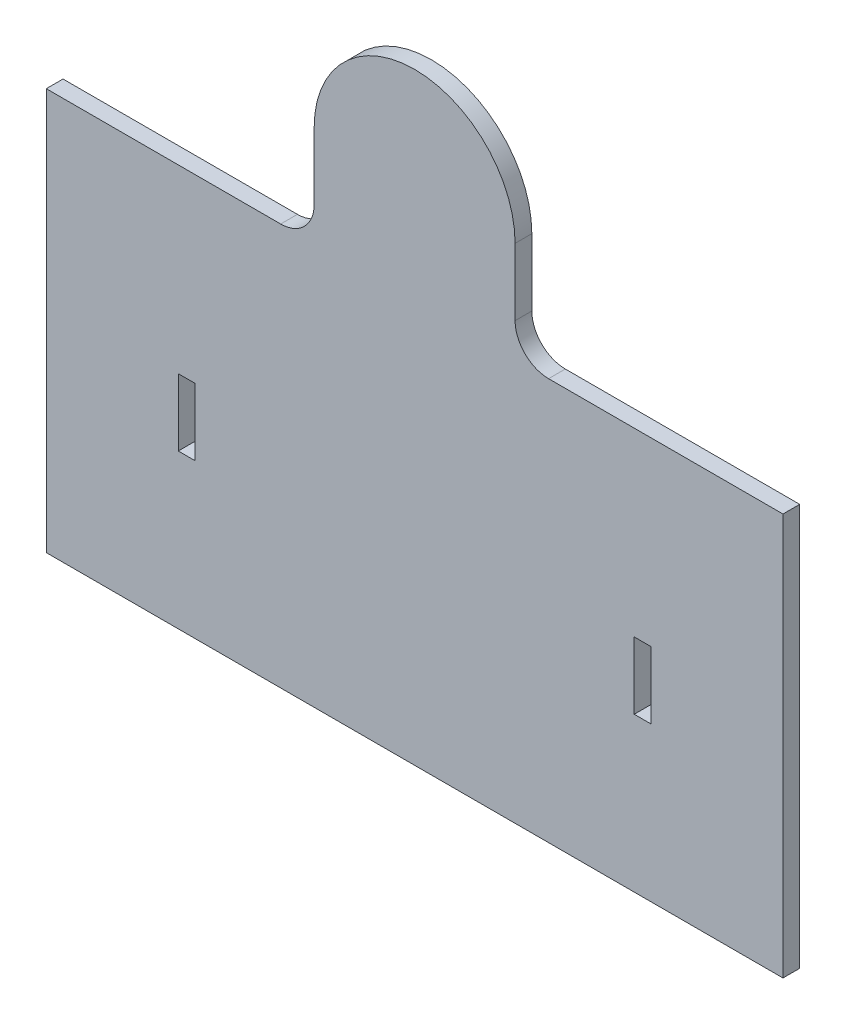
ISO-10303-21;
HEADER;
FILE_DESCRIPTION(('STEP AP214'),'2;1');
FILE_NAME('part.step','',(''),(''),'','','');
FILE_SCHEMA(('AUTOMOTIVE_DESIGN { 1 0 10303 214 1 1 1 1 }'));
ENDSEC;
DATA;
#1=APPLICATION_CONTEXT('core data for automotive mechanical design processes');
#2=APPLICATION_PROTOCOL_DEFINITION('international standard','automotive_design',2000,#1);
#3=PRODUCT_CONTEXT('',#1,'mechanical');
#4=PRODUCT('Part','Part','',(#3));
#5=PRODUCT_RELATED_PRODUCT_CATEGORY('part','',(#4));
#6=PRODUCT_DEFINITION_FORMATION('','',#4);
#7=PRODUCT_DEFINITION_CONTEXT('part definition',#1,'design');
#8=PRODUCT_DEFINITION('design','',#6,#7);
#9=PRODUCT_DEFINITION_SHAPE('','',#8);
#10=(LENGTH_UNIT() NAMED_UNIT(*) SI_UNIT(.MILLI.,.METRE.));
#11=(NAMED_UNIT(*) PLANE_ANGLE_UNIT() SI_UNIT($,.RADIAN.));
#12=(NAMED_UNIT(*) SI_UNIT($,.STERADIAN.) SOLID_ANGLE_UNIT());
#13=UNCERTAINTY_MEASURE_WITH_UNIT(LENGTH_MEASURE(1.E-05),#10,'distance_accuracy_value','');
#14=(GEOMETRIC_REPRESENTATION_CONTEXT(3) GLOBAL_UNCERTAINTY_ASSIGNED_CONTEXT((#13)) GLOBAL_UNIT_ASSIGNED_CONTEXT((#10,
#11,#12)) REPRESENTATION_CONTEXT('',''));
#15=CARTESIAN_POINT('',(0.,0.,0.));
#16=DIRECTION('',(0.,0.,1.));
#17=DIRECTION('',(1.,0.,0.));
#18=AXIS2_PLACEMENT_3D('',#15,#16,#17);
#19=CARTESIAN_POINT('',(-12.79,34.2445415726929,2.5));
#20=DIRECTION('',(0.,0.,-1.));
#21=DIRECTION('',(-1.,0.,0.));
#22=AXIS2_PLACEMENT_3D('',#19,#20,#21);
#23=CYLINDRICAL_SURFACE('',#22,5.);
#24=CARTESIAN_POINT('',(-12.79,34.2445415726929,0.));
#25=DIRECTION('',(0.,0.,1.));
#26=DIRECTION('',(1.,0.,0.));
#27=AXIS2_PLACEMENT_3D('',#24,#25,#26);
#28=CIRCLE('',#27,5.);
#29=CARTESIAN_POINT('',(-17.79,34.2445415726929,0.));
#30=VERTEX_POINT('',#29);
#31=CARTESIAN_POINT('',(-12.79,29.2445415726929,0.));
#32=VERTEX_POINT('',#31);
#33=EDGE_CURVE('E215',#30,#32,#28,.T.);
#34=ORIENTED_EDGE('',*,*,#33,.F.);
#35=DIRECTION('',(0.,0.,-1.));
#36=VECTOR('',#35,1.);
#37=CARTESIAN_POINT('',(-17.79,34.2445415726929,2.5));
#38=LINE('',#37,#36);
#39=CARTESIAN_POINT('',(-17.79,34.2445415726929,2.5));
#40=VERTEX_POINT('',#39);
#41=EDGE_CURVE('E11',#40,#30,#38,.T.);
#42=ORIENTED_EDGE('',*,*,#41,.F.);
#43=CARTESIAN_POINT('',(-12.79,34.2445415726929,2.5));
#44=DIRECTION('',(0.,0.,1.));
#45=DIRECTION('',(1.,0.,0.));
#46=AXIS2_PLACEMENT_3D('',#43,#44,#45);
#47=CIRCLE('',#46,5.);
#48=CARTESIAN_POINT('',(-12.79,29.2445415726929,2.5));
#49=VERTEX_POINT('',#48);
#50=EDGE_CURVE('E263',#40,#49,#47,.T.);
#51=ORIENTED_EDGE('',*,*,#50,.T.);
#52=DIRECTION('',(0.,0.,-1.));
#53=VECTOR('',#52,1.);
#54=CARTESIAN_POINT('',(-12.79,29.2445415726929,2.5));
#55=LINE('',#54,#53);
#56=EDGE_CURVE('E46',#49,#32,#55,.T.);
#57=ORIENTED_EDGE('',*,*,#56,.T.);
#58=EDGE_LOOP('',(#34,#42,#51,#57));
#59=FACE_BOUND('',#58,.T.);
#60=ADVANCED_FACE('F43',(#59),#23,.F.);
#61=CARTESIAN_POINT('',(-17.79,44.2445415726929,2.5));
#62=DIRECTION('',(1.,0.,0.));
#63=DIRECTION('',(0.,0.,-1.));
#64=AXIS2_PLACEMENT_3D('',#61,#62,#63);
#65=PLANE('',#64);
#66=DIRECTION('',(0.,-1.,0.));
#67=VECTOR('',#66,1.);
#68=CARTESIAN_POINT('',(-17.79,44.2445415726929,0.));
#69=LINE('',#68,#67);
#70=CARTESIAN_POINT('',(-17.79,44.2445415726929,0.));
#71=VERTEX_POINT('',#70);
#72=EDGE_CURVE('E268',#71,#30,#69,.T.);
#73=ORIENTED_EDGE('',*,*,#72,.F.);
#74=DIRECTION('',(0.,0.,-1.));
#75=VECTOR('',#74,1.);
#76=CARTESIAN_POINT('',(-17.79,44.2445415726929,2.5));
#77=LINE('',#76,#75);
#78=CARTESIAN_POINT('',(-17.79,44.2445415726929,2.5));
#79=VERTEX_POINT('',#78);
#80=EDGE_CURVE('E52',#79,#71,#77,.T.);
#81=ORIENTED_EDGE('',*,*,#80,.F.);
#82=DIRECTION('',(0.,-1.,0.));
#83=VECTOR('',#82,1.);
#84=CARTESIAN_POINT('',(-17.79,44.2445415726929,2.5));
#85=LINE('',#84,#83);
#86=EDGE_CURVE('E296',#79,#40,#85,.T.);
#87=ORIENTED_EDGE('',*,*,#86,.T.);
#88=ORIENTED_EDGE('',*,*,#41,.T.);
#89=EDGE_LOOP('',(#73,#81,#87,#88));
#90=FACE_BOUND('',#89,.T.);
#91=ADVANCED_FACE('F373',(#90),#65,.T.);
#92=CARTESIAN_POINT('',(-32.79,44.2445415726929,2.5));
#93=DIRECTION('',(0.,0.,-1.));
#94=DIRECTION('',(-1.,0.,0.));
#95=AXIS2_PLACEMENT_3D('',#92,#93,#94);
#96=CYLINDRICAL_SURFACE('',#95,15.);
#97=CARTESIAN_POINT('',(-32.79,44.2445415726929,0.));
#98=DIRECTION('',(0.,0.,1.));
#99=DIRECTION('',(1.,0.,0.));
#100=AXIS2_PLACEMENT_3D('',#97,#98,#99);
#101=CIRCLE('',#100,15.);
#102=CARTESIAN_POINT('',(-47.79,44.2445415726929,0.));
#103=VERTEX_POINT('',#102);
#104=EDGE_CURVE('E330',#71,#103,#101,.T.);
#105=ORIENTED_EDGE('',*,*,#104,.T.);
#106=DIRECTION('',(0.,0.,-1.));
#107=VECTOR('',#106,1.);
#108=CARTESIAN_POINT('',(-47.79,44.2445415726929,2.5));
#109=LINE('',#108,#107);
#110=CARTESIAN_POINT('',(-47.79,44.2445415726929,2.5));
#111=VERTEX_POINT('',#110);
#112=EDGE_CURVE('E338',#111,#103,#109,.T.);
#113=ORIENTED_EDGE('',*,*,#112,.F.);
#114=CARTESIAN_POINT('',(-32.79,44.2445415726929,2.5));
#115=DIRECTION('',(0.,0.,1.));
#116=DIRECTION('',(1.,0.,0.));
#117=AXIS2_PLACEMENT_3D('',#114,#115,#116);
#118=CIRCLE('',#117,15.);
#119=EDGE_CURVE('E293',#79,#111,#118,.T.);
#120=ORIENTED_EDGE('',*,*,#119,.F.);
#121=ORIENTED_EDGE('',*,*,#80,.T.);
#122=EDGE_LOOP('',(#105,#113,#120,#121));
#123=FACE_BOUND('',#122,.T.);
#124=ADVANCED_FACE('F405',(#123),#96,.T.);
#125=CARTESIAN_POINT('',(-47.79,44.2445415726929,2.5));
#126=DIRECTION('',(1.,0.,0.));
#127=DIRECTION('',(0.,0.,-1.));
#128=AXIS2_PLACEMENT_3D('',#125,#126,#127);
#129=PLANE('',#128);
#130=DIRECTION('',(0.,-1.,0.));
#131=VECTOR('',#130,1.);
#132=CARTESIAN_POINT('',(-47.79,44.2445415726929,0.));
#133=LINE('',#132,#131);
#134=CARTESIAN_POINT('',(-47.79,34.2445415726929,0.));
#135=VERTEX_POINT('',#134);
#136=EDGE_CURVE('E326',#103,#135,#133,.T.);
#137=ORIENTED_EDGE('',*,*,#136,.T.);
#138=DIRECTION('',(0.,0.,-1.));
#139=VECTOR('',#138,1.);
#140=CARTESIAN_POINT('',(-47.79,34.2445415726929,2.5));
#141=LINE('',#140,#139);
#142=CARTESIAN_POINT('',(-47.79,34.2445415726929,2.5));
#143=VERTEX_POINT('',#142);
#144=EDGE_CURVE('E342',#143,#135,#141,.T.);
#145=ORIENTED_EDGE('',*,*,#144,.F.);
#146=DIRECTION('',(0.,-1.,0.));
#147=VECTOR('',#146,1.);
#148=CARTESIAN_POINT('',(-47.79,44.2445415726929,2.5));
#149=LINE('',#148,#147);
#150=EDGE_CURVE('E290',#111,#143,#149,.T.);
#151=ORIENTED_EDGE('',*,*,#150,.F.);
#152=ORIENTED_EDGE('',*,*,#112,.T.);
#153=EDGE_LOOP('',(#137,#145,#151,#152));
#154=FACE_BOUND('',#153,.T.);
#155=ADVANCED_FACE('F402',(#154),#129,.F.);
#156=CARTESIAN_POINT('',(-52.79,34.2445415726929,2.5));
#157=DIRECTION('',(0.,0.,-1.));
#158=DIRECTION('',(-1.,0.,0.));
#159=AXIS2_PLACEMENT_3D('',#156,#157,#158);
#160=CYLINDRICAL_SURFACE('',#159,5.);
#161=CARTESIAN_POINT('',(-52.79,34.2445415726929,0.));
#162=DIRECTION('',(0.,0.,1.));
#163=DIRECTION('',(1.,0.,0.));
#164=AXIS2_PLACEMENT_3D('',#161,#162,#163);
#165=CIRCLE('',#164,5.);
#166=CARTESIAN_POINT('',(-52.79,29.2445415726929,0.));
#167=VERTEX_POINT('',#166);
#168=EDGE_CURVE('E322',#167,#135,#165,.T.);
#169=ORIENTED_EDGE('',*,*,#168,.F.);
#170=DIRECTION('',(0.,0.,-1.));
#171=VECTOR('',#170,1.);
#172=CARTESIAN_POINT('',(-52.79,29.2445415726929,2.5));
#173=LINE('',#172,#171);
#174=CARTESIAN_POINT('',(-52.79,29.2445415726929,2.5));
#175=VERTEX_POINT('',#174);
#176=EDGE_CURVE('E345',#175,#167,#173,.T.);
#177=ORIENTED_EDGE('',*,*,#176,.F.);
#178=CARTESIAN_POINT('',(-52.79,34.2445415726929,2.5));
#179=DIRECTION('',(0.,0.,1.));
#180=DIRECTION('',(1.,0.,0.));
#181=AXIS2_PLACEMENT_3D('',#178,#179,#180);
#182=CIRCLE('',#181,5.);
#183=EDGE_CURVE('E286',#175,#143,#182,.T.);
#184=ORIENTED_EDGE('',*,*,#183,.T.);
#185=ORIENTED_EDGE('',*,*,#144,.T.);
#186=EDGE_LOOP('',(#169,#177,#184,#185));
#187=FACE_BOUND('',#186,.T.);
#188=ADVANCED_FACE('F398',(#187),#160,.F.);
#189=CARTESIAN_POINT('',(-52.79,29.2445415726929,2.5));
#190=DIRECTION('',(0.,-1.,0.));
#191=DIRECTION('',(0.,0.,-1.));
#192=AXIS2_PLACEMENT_3D('',#189,#190,#191);
#193=PLANE('',#192);
#194=DIRECTION('',(-1.,0.,0.));
#195=VECTOR('',#194,1.);
#196=CARTESIAN_POINT('',(-52.79,29.2445415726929,0.));
#197=LINE('',#196,#195);
#198=CARTESIAN_POINT('',(-87.79,29.2445415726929,0.));
#199=VERTEX_POINT('',#198);
#200=EDGE_CURVE('E319',#167,#199,#197,.T.);
#201=ORIENTED_EDGE('',*,*,#200,.T.);
#202=DIRECTION('',(0.,0.,-1.));
#203=VECTOR('',#202,1.);
#204=CARTESIAN_POINT('',(-87.79,29.2445415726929,2.5));
#205=LINE('',#204,#203);
#206=CARTESIAN_POINT('',(-87.79,29.2445415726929,2.5));
#207=VERTEX_POINT('',#206);
#208=EDGE_CURVE('E348',#207,#199,#205,.T.);
#209=ORIENTED_EDGE('',*,*,#208,.F.);
#210=DIRECTION('',(-1.,0.,0.));
#211=VECTOR('',#210,1.);
#212=CARTESIAN_POINT('',(-52.79,29.2445415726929,2.5));
#213=LINE('',#212,#211);
#214=EDGE_CURVE('E283',#175,#207,#213,.T.);
#215=ORIENTED_EDGE('',*,*,#214,.F.);
#216=ORIENTED_EDGE('',*,*,#176,.T.);
#217=EDGE_LOOP('',(#201,#209,#215,#216));
#218=FACE_BOUND('',#217,.T.);
#219=ADVANCED_FACE('F394',(#218),#193,.F.);
#220=CARTESIAN_POINT('',(-87.79,29.2445415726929,2.5));
#221=DIRECTION('',(1.,0.,0.));
#222=DIRECTION('',(0.,1.,0.));
#223=AXIS2_PLACEMENT_3D('',#220,#221,#222);
#224=PLANE('',#223);
#225=DIRECTION('',(0.,-1.,0.));
#226=VECTOR('',#225,1.);
#227=CARTESIAN_POINT('',(-87.79,29.2445415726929,0.));
#228=LINE('',#227,#226);
#229=CARTESIAN_POINT('',(-87.7900000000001,-30.7554584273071,0.));
#230=VERTEX_POINT('',#229);
#231=EDGE_CURVE('E315',#199,#230,#228,.T.);
#232=ORIENTED_EDGE('',*,*,#231,.T.);
#233=DIRECTION('',(0.,0.,-1.));
#234=VECTOR('',#233,1.);
#235=CARTESIAN_POINT('',(-87.7900000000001,-30.7554584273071,2.5));
#236=LINE('',#235,#234);
#237=CARTESIAN_POINT('',(-87.7900000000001,-30.7554584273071,2.5));
#238=VERTEX_POINT('',#237);
#239=EDGE_CURVE('E352',#238,#230,#236,.T.);
#240=ORIENTED_EDGE('',*,*,#239,.F.);
#241=DIRECTION('',(0.,-1.,0.));
#242=VECTOR('',#241,1.);
#243=CARTESIAN_POINT('',(-87.79,29.2445415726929,2.5));
#244=LINE('',#243,#242);
#245=EDGE_CURVE('E280',#207,#238,#244,.T.);
#246=ORIENTED_EDGE('',*,*,#245,.F.);
#247=ORIENTED_EDGE('',*,*,#208,.T.);
#248=EDGE_LOOP('',(#232,#240,#246,#247));
#249=FACE_BOUND('',#248,.T.);
#250=ADVANCED_FACE('F390',(#249),#224,.F.);
#251=CARTESIAN_POINT('',(22.2099999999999,-30.7554584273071,2.5));
#252=DIRECTION('',(0.,-1.,0.));
#253=DIRECTION('',(1.,0.,0.));
#254=AXIS2_PLACEMENT_3D('',#251,#252,#253);
#255=PLANE('',#254);
#256=DIRECTION('',(-1.,0.,0.));
#257=VECTOR('',#256,1.);
#258=CARTESIAN_POINT('',(22.2099999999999,-30.7554584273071,0.));
#259=LINE('',#258,#257);
#260=CARTESIAN_POINT('',(22.2099999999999,-30.7554584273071,0.));
#261=VERTEX_POINT('',#260);
#262=EDGE_CURVE('E311',#261,#230,#259,.T.);
#263=ORIENTED_EDGE('',*,*,#262,.F.);
#264=DIRECTION('',(0.,0.,-1.));
#265=VECTOR('',#264,1.);
#266=CARTESIAN_POINT('',(22.2099999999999,-30.7554584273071,2.5));
#267=LINE('',#266,#265);
#268=CARTESIAN_POINT('',(22.2099999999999,-30.7554584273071,2.5));
#269=VERTEX_POINT('',#268);
#270=EDGE_CURVE('E355',#269,#261,#267,.T.);
#271=ORIENTED_EDGE('',*,*,#270,.F.);
#272=DIRECTION('',(-1.,0.,0.));
#273=VECTOR('',#272,1.);
#274=CARTESIAN_POINT('',(22.2099999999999,-30.7554584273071,2.5));
#275=LINE('',#274,#273);
#276=EDGE_CURVE('E276',#269,#238,#275,.T.);
#277=ORIENTED_EDGE('',*,*,#276,.T.);
#278=ORIENTED_EDGE('',*,*,#239,.T.);
#279=EDGE_LOOP('',(#263,#271,#277,#278));
#280=FACE_BOUND('',#279,.T.);
#281=ADVANCED_FACE('F386',(#280),#255,.T.);
#282=CARTESIAN_POINT('',(22.21,29.2445415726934,2.5));
#283=DIRECTION('',(1.,0.,0.));
#284=DIRECTION('',(0.,1.,0.));
#285=AXIS2_PLACEMENT_3D('',#282,#283,#284);
#286=PLANE('',#285);
#287=DIRECTION('',(0.,-1.,0.));
#288=VECTOR('',#287,1.);
#289=CARTESIAN_POINT('',(22.21,29.2445415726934,0.));
#290=LINE('',#289,#288);
#291=CARTESIAN_POINT('',(22.21,29.2445415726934,0.));
#292=VERTEX_POINT('',#291);
#293=EDGE_CURVE('E307',#292,#261,#290,.T.);
#294=ORIENTED_EDGE('',*,*,#293,.F.);
#295=DIRECTION('',(0.,0.,-1.));
#296=VECTOR('',#295,1.);
#297=CARTESIAN_POINT('',(22.21,29.2445415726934,2.5));
#298=LINE('',#297,#296);
#299=CARTESIAN_POINT('',(22.21,29.2445415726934,2.5));
#300=VERTEX_POINT('',#299);
#301=EDGE_CURVE('E357',#300,#292,#298,.T.);
#302=ORIENTED_EDGE('',*,*,#301,.F.);
#303=DIRECTION('',(0.,-1.,0.));
#304=VECTOR('',#303,1.);
#305=CARTESIAN_POINT('',(22.21,29.2445415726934,2.5));
#306=LINE('',#305,#304);
#307=EDGE_CURVE('E272',#300,#269,#306,.T.);
#308=ORIENTED_EDGE('',*,*,#307,.T.);
#309=ORIENTED_EDGE('',*,*,#270,.T.);
#310=EDGE_LOOP('',(#294,#302,#308,#309));
#311=FACE_BOUND('',#310,.T.);
#312=ADVANCED_FACE('F381',(#311),#286,.T.);
#313=CARTESIAN_POINT('',(-12.79,29.2445415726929,2.5));
#314=DIRECTION('',(0.,1.,0.));
#315=DIRECTION('',(-1.,0.,0.));
#316=AXIS2_PLACEMENT_3D('',#313,#314,#315);
#317=PLANE('',#316);
#318=DIRECTION('',(1.,0.,0.));
#319=VECTOR('',#318,1.);
#320=CARTESIAN_POINT('',(-12.79,29.2445415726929,0.));
#321=LINE('',#320,#319);
#322=EDGE_CURVE('E303',#32,#292,#321,.T.);
#323=ORIENTED_EDGE('',*,*,#322,.F.);
#324=ORIENTED_EDGE('',*,*,#56,.F.);
#325=DIRECTION('',(1.,0.,0.));
#326=VECTOR('',#325,1.);
#327=CARTESIAN_POINT('',(-12.79,29.2445415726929,2.5));
#328=LINE('',#327,#326);
#329=EDGE_CURVE('E267',#49,#300,#328,.T.);
#330=ORIENTED_EDGE('',*,*,#329,.T.);
#331=ORIENTED_EDGE('',*,*,#301,.T.);
#332=EDGE_LOOP('',(#323,#324,#330,#331));
#333=FACE_BOUND('',#332,.T.);
#334=ADVANCED_FACE('F367',(#333),#317,.T.);
#335=CARTESIAN_POINT('',(-12.79,34.2445415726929,2.5));
#336=DIRECTION('',(0.,0.,1.));
#337=DIRECTION('',(1.,0.,0.));
#338=AXIS2_PLACEMENT_3D('',#335,#336,#337);
#339=PLANE('',#338);
#340=DIRECTION('',(0.,-1.,0.));
#341=VECTOR('',#340,1.);
#342=CARTESIAN_POINT('',(-68.083259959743,2.24454157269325,2.5));
#343=LINE('',#342,#341);
#344=CARTESIAN_POINT('',(-68.083259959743,2.24454157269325,2.5));
#345=VERTEX_POINT('',#344);
#346=CARTESIAN_POINT('',(-68.083259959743,-7.75545842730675,2.5));
#347=VERTEX_POINT('',#346);
#348=EDGE_CURVE('E60',#345,#347,#343,.T.);
#349=ORIENTED_EDGE('',*,*,#348,.F.);
#350=DIRECTION('',(-1.,0.,0.));
#351=VECTOR('',#350,1.);
#352=CARTESIAN_POINT('',(-68.083259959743,2.24454157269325,2.5));
#353=LINE('',#352,#351);
#354=CARTESIAN_POINT('',(-65.583259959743,2.24454157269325,2.5));
#355=VERTEX_POINT('',#354);
#356=EDGE_CURVE('E193',#355,#345,#353,.T.);
#357=ORIENTED_EDGE('',*,*,#356,.F.);
#358=DIRECTION('',(0.,1.,0.));
#359=VECTOR('',#358,1.);
#360=CARTESIAN_POINT('',(-65.583259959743,2.24454157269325,2.5));
#361=LINE('',#360,#359);
#362=CARTESIAN_POINT('',(-65.583259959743,-7.75545842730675,2.5));
#363=VERTEX_POINT('',#362);
#364=EDGE_CURVE('E197',#363,#355,#361,.T.);
#365=ORIENTED_EDGE('',*,*,#364,.F.);
#366=DIRECTION('',(1.,0.,0.));
#367=VECTOR('',#366,1.);
#368=CARTESIAN_POINT('',(-68.083259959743,-7.75545842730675,2.5));
#369=LINE('',#368,#367);
#370=EDGE_CURVE('E206',#347,#363,#369,.T.);
#371=ORIENTED_EDGE('',*,*,#370,.F.);
#372=EDGE_LOOP('',(#349,#357,#365,#371));
#373=FACE_BOUND('',#372,.T.);
#374=DIRECTION('',(0.,-1.,0.));
#375=VECTOR('',#374,1.);
#376=CARTESIAN_POINT('',(0.,2.24454157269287,2.5));
#377=LINE('',#376,#375);
#378=CARTESIAN_POINT('',(0.,2.24454157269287,2.5));
#379=VERTEX_POINT('',#378);
#380=CARTESIAN_POINT('',(0.,-7.75545842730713,2.5));
#381=VERTEX_POINT('',#380);
#382=EDGE_CURVE('E68',#379,#381,#377,.T.);
#383=ORIENTED_EDGE('',*,*,#382,.F.);
#384=DIRECTION('',(-1.,0.,0.));
#385=VECTOR('',#384,1.);
#386=CARTESIAN_POINT('',(0.,2.24454157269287,2.5));
#387=LINE('',#386,#385);
#388=CARTESIAN_POINT('',(2.49999999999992,2.24454157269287,2.5));
#389=VERTEX_POINT('',#388);
#390=EDGE_CURVE('E234',#389,#379,#387,.T.);
#391=ORIENTED_EDGE('',*,*,#390,.F.);
#392=DIRECTION('',(0.,1.,0.));
#393=VECTOR('',#392,1.);
#394=CARTESIAN_POINT('',(2.49999999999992,2.24454157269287,2.5));
#395=LINE('',#394,#393);
#396=CARTESIAN_POINT('',(2.49999999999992,-7.75545842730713,2.5));
#397=VERTEX_POINT('',#396);
#398=EDGE_CURVE('E238',#397,#389,#395,.T.);
#399=ORIENTED_EDGE('',*,*,#398,.F.);
#400=DIRECTION('',(1.,0.,0.));
#401=VECTOR('',#400,1.);
#402=CARTESIAN_POINT('',(0.,-7.75545842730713,2.5));
#403=LINE('',#402,#401);
#404=EDGE_CURVE('E243',#381,#397,#403,.T.);
#405=ORIENTED_EDGE('',*,*,#404,.F.);
#406=EDGE_LOOP('',(#383,#391,#399,#405));
#407=FACE_BOUND('',#406,.T.);
#408=ORIENTED_EDGE('',*,*,#50,.F.);
#409=ORIENTED_EDGE('',*,*,#86,.F.);
#410=ORIENTED_EDGE('',*,*,#119,.T.);
#411=ORIENTED_EDGE('',*,*,#150,.T.);
#412=ORIENTED_EDGE('',*,*,#183,.F.);
#413=ORIENTED_EDGE('',*,*,#214,.T.);
#414=ORIENTED_EDGE('',*,*,#245,.T.);
#415=ORIENTED_EDGE('',*,*,#276,.F.);
#416=ORIENTED_EDGE('',*,*,#307,.F.);
#417=ORIENTED_EDGE('',*,*,#329,.F.);
#418=EDGE_LOOP('',(#408,#409,#410,#411,#412,#413,#414,#415,#416,#417));
#419=FACE_BOUND('',#418,.T.);
#420=ADVANCED_FACE('F377',(#373,#407,#419),#339,.T.);
#421=CARTESIAN_POINT('',(-12.79,34.2445415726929,0.));
#422=DIRECTION('',(0.,0.,1.));
#423=DIRECTION('',(1.,0.,0.));
#424=AXIS2_PLACEMENT_3D('',#421,#422,#423);
#425=PLANE('',#424);
#426=DIRECTION('',(-1.,0.,0.));
#427=VECTOR('',#426,1.);
#428=CARTESIAN_POINT('',(-68.083259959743,2.24454157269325,0.));
#429=LINE('',#428,#427);
#430=CARTESIAN_POINT('',(-65.583259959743,2.24454157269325,0.));
#431=VERTEX_POINT('',#430);
#432=CARTESIAN_POINT('',(-68.083259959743,2.24454157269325,0.));
#433=VERTEX_POINT('',#432);
#434=EDGE_CURVE('E178',#431,#433,#429,.T.);
#435=ORIENTED_EDGE('',*,*,#434,.T.);
#436=DIRECTION('',(0.,-1.,0.));
#437=VECTOR('',#436,1.);
#438=CARTESIAN_POINT('',(-68.083259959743,2.24454157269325,0.));
#439=LINE('',#438,#437);
#440=CARTESIAN_POINT('',(-68.083259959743,-7.75545842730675,0.));
#441=VERTEX_POINT('',#440);
#442=EDGE_CURVE('E171',#433,#441,#439,.T.);
#443=ORIENTED_EDGE('',*,*,#442,.T.);
#444=DIRECTION('',(1.,0.,0.));
#445=VECTOR('',#444,1.);
#446=CARTESIAN_POINT('',(-68.083259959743,-7.75545842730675,0.));
#447=LINE('',#446,#445);
#448=CARTESIAN_POINT('',(-65.583259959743,-7.75545842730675,0.));
#449=VERTEX_POINT('',#448);
#450=EDGE_CURVE('E182',#441,#449,#447,.T.);
#451=ORIENTED_EDGE('',*,*,#450,.T.);
#452=DIRECTION('',(0.,1.,0.));
#453=VECTOR('',#452,1.);
#454=CARTESIAN_POINT('',(-65.583259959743,2.24454157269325,0.));
#455=LINE('',#454,#453);
#456=EDGE_CURVE('E187',#449,#431,#455,.T.);
#457=ORIENTED_EDGE('',*,*,#456,.T.);
#458=EDGE_LOOP('',(#435,#443,#451,#457));
#459=FACE_BOUND('',#458,.T.);
#460=DIRECTION('',(-1.,0.,0.));
#461=VECTOR('',#460,1.);
#462=CARTESIAN_POINT('',(0.,2.24454157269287,0.));
#463=LINE('',#462,#461);
#464=CARTESIAN_POINT('',(2.49999999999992,2.24454157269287,0.));
#465=VERTEX_POINT('',#464);
#466=CARTESIAN_POINT('',(0.,2.24454157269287,0.));
#467=VERTEX_POINT('',#466);
#468=EDGE_CURVE('E224',#465,#467,#463,.T.);
#469=ORIENTED_EDGE('',*,*,#468,.T.);
#470=DIRECTION('',(0.,-1.,0.));
#471=VECTOR('',#470,1.);
#472=CARTESIAN_POINT('',(0.,2.24454157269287,0.));
#473=LINE('',#472,#471);
#474=CARTESIAN_POINT('',(0.,-7.75545842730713,0.));
#475=VERTEX_POINT('',#474);
#476=EDGE_CURVE('E239',#467,#475,#473,.T.);
#477=ORIENTED_EDGE('',*,*,#476,.T.);
#478=DIRECTION('',(1.,0.,0.));
#479=VECTOR('',#478,1.);
#480=CARTESIAN_POINT('',(0.,-7.75545842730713,0.));
#481=LINE('',#480,#479);
#482=CARTESIAN_POINT('',(2.49999999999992,-7.75545842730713,0.));
#483=VERTEX_POINT('',#482);
#484=EDGE_CURVE('E256',#475,#483,#481,.T.);
#485=ORIENTED_EDGE('',*,*,#484,.T.);
#486=DIRECTION('',(0.,1.,0.));
#487=VECTOR('',#486,1.);
#488=CARTESIAN_POINT('',(2.49999999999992,2.24454157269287,0.));
#489=LINE('',#488,#487);
#490=EDGE_CURVE('E252',#483,#465,#489,.T.);
#491=ORIENTED_EDGE('',*,*,#490,.T.);
#492=EDGE_LOOP('',(#469,#477,#485,#491));
#493=FACE_BOUND('',#492,.T.);
#494=ORIENTED_EDGE('',*,*,#33,.T.);
#495=ORIENTED_EDGE('',*,*,#322,.T.);
#496=ORIENTED_EDGE('',*,*,#293,.T.);
#497=ORIENTED_EDGE('',*,*,#262,.T.);
#498=ORIENTED_EDGE('',*,*,#231,.F.);
#499=ORIENTED_EDGE('',*,*,#200,.F.);
#500=ORIENTED_EDGE('',*,*,#168,.T.);
#501=ORIENTED_EDGE('',*,*,#136,.F.);
#502=ORIENTED_EDGE('',*,*,#104,.F.);
#503=ORIENTED_EDGE('',*,*,#72,.T.);
#504=EDGE_LOOP('',(#494,#495,#496,#497,#498,#499,#500,#501,#502,#503));
#505=FACE_BOUND('',#504,.T.);
#506=ADVANCED_FACE('F189',(#459,#493,#505),#425,.F.);
#507=CARTESIAN_POINT('',(0.,2.24454157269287,0.));
#508=DIRECTION('',(-1.,0.,0.));
#509=DIRECTION('',(0.,-1.,0.));
#510=AXIS2_PLACEMENT_3D('',#507,#508,#509);
#511=PLANE('',#510);
#512=ORIENTED_EDGE('',*,*,#382,.T.);
#513=DIRECTION('',(0.,0.,1.));
#514=VECTOR('',#513,1.);
#515=CARTESIAN_POINT('',(0.,-7.75545842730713,0.));
#516=LINE('',#515,#514);
#517=EDGE_CURVE('E221',#475,#381,#516,.T.);
#518=ORIENTED_EDGE('',*,*,#517,.F.);
#519=ORIENTED_EDGE('',*,*,#476,.F.);
#520=DIRECTION('',(0.,0.,1.));
#521=VECTOR('',#520,1.);
#522=CARTESIAN_POINT('',(0.,2.24454157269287,0.));
#523=LINE('',#522,#521);
#524=EDGE_CURVE('E231',#467,#379,#523,.T.);
#525=ORIENTED_EDGE('',*,*,#524,.T.);
#526=EDGE_LOOP('',(#512,#518,#519,#525));
#527=FACE_BOUND('',#526,.T.);
#528=ADVANCED_FACE('F506',(#527),#511,.F.);
#529=CARTESIAN_POINT('',(0.,2.24454157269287,0.));
#530=DIRECTION('',(0.,1.,0.));
#531=DIRECTION('',(0.,0.,1.));
#532=AXIS2_PLACEMENT_3D('',#529,#530,#531);
#533=PLANE('',#532);
#534=ORIENTED_EDGE('',*,*,#390,.T.);
#535=ORIENTED_EDGE('',*,*,#524,.F.);
#536=ORIENTED_EDGE('',*,*,#468,.F.);
#537=DIRECTION('',(0.,0.,1.));
#538=VECTOR('',#537,1.);
#539=CARTESIAN_POINT('',(2.49999999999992,2.24454157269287,0.));
#540=LINE('',#539,#538);
#541=EDGE_CURVE('E228',#465,#389,#540,.T.);
#542=ORIENTED_EDGE('',*,*,#541,.T.);
#543=EDGE_LOOP('',(#534,#535,#536,#542));
#544=FACE_BOUND('',#543,.T.);
#545=ADVANCED_FACE('F516',(#544),#533,.F.);
#546=CARTESIAN_POINT('',(2.49999999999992,2.24454157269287,0.));
#547=DIRECTION('',(1.,0.,0.));
#548=DIRECTION('',(0.,1.,0.));
#549=AXIS2_PLACEMENT_3D('',#546,#547,#548);
#550=PLANE('',#549);
#551=ORIENTED_EDGE('',*,*,#398,.T.);
#552=ORIENTED_EDGE('',*,*,#541,.F.);
#553=ORIENTED_EDGE('',*,*,#490,.F.);
#554=DIRECTION('',(0.,0.,1.));
#555=VECTOR('',#554,1.);
#556=CARTESIAN_POINT('',(2.49999999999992,-7.75545842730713,0.));
#557=LINE('',#556,#555);
#558=EDGE_CURVE('E225',#483,#397,#557,.T.);
#559=ORIENTED_EDGE('',*,*,#558,.T.);
#560=EDGE_LOOP('',(#551,#552,#553,#559));
#561=FACE_BOUND('',#560,.T.);
#562=ADVANCED_FACE('F526',(#561),#550,.F.);
#563=CARTESIAN_POINT('',(0.,-7.75545842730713,0.));
#564=DIRECTION('',(0.,-1.,0.));
#565=DIRECTION('',(0.,0.,-1.));
#566=AXIS2_PLACEMENT_3D('',#563,#564,#565);
#567=PLANE('',#566);
#568=ORIENTED_EDGE('',*,*,#404,.T.);
#569=ORIENTED_EDGE('',*,*,#558,.F.);
#570=ORIENTED_EDGE('',*,*,#484,.F.);
#571=ORIENTED_EDGE('',*,*,#517,.T.);
#572=EDGE_LOOP('',(#568,#569,#570,#571));
#573=FACE_BOUND('',#572,.T.);
#574=ADVANCED_FACE('F537',(#573),#567,.F.);
#575=CARTESIAN_POINT('',(-68.083259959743,2.24454157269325,0.));
#576=DIRECTION('',(-1.,0.,0.));
#577=DIRECTION('',(0.,0.,1.));
#578=AXIS2_PLACEMENT_3D('',#575,#576,#577);
#579=PLANE('',#578);
#580=ORIENTED_EDGE('',*,*,#348,.T.);
#581=DIRECTION('',(0.,0.,1.));
#582=VECTOR('',#581,1.);
#583=CARTESIAN_POINT('',(-68.083259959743,-7.75545842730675,0.));
#584=LINE('',#583,#582);
#585=EDGE_CURVE('E167',#441,#347,#584,.T.);
#586=ORIENTED_EDGE('',*,*,#585,.F.);
#587=ORIENTED_EDGE('',*,*,#442,.F.);
#588=DIRECTION('',(0.,0.,1.));
#589=VECTOR('',#588,1.);
#590=CARTESIAN_POINT('',(-68.083259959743,2.24454157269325,0.));
#591=LINE('',#590,#589);
#592=EDGE_CURVE('E212',#433,#345,#591,.T.);
#593=ORIENTED_EDGE('',*,*,#592,.T.);
#594=EDGE_LOOP('',(#580,#586,#587,#593));
#595=FACE_BOUND('',#594,.T.);
#596=ADVANCED_FACE('F169',(#595),#579,.F.);
#597=CARTESIAN_POINT('',(-68.083259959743,2.24454157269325,0.));
#598=DIRECTION('',(0.,1.,0.));
#599=DIRECTION('',(0.,0.,1.));
#600=AXIS2_PLACEMENT_3D('',#597,#598,#599);
#601=PLANE('',#600);
#602=ORIENTED_EDGE('',*,*,#356,.T.);
#603=ORIENTED_EDGE('',*,*,#592,.F.);
#604=ORIENTED_EDGE('',*,*,#434,.F.);
#605=DIRECTION('',(0.,0.,1.));
#606=VECTOR('',#605,1.);
#607=CARTESIAN_POINT('',(-65.583259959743,2.24454157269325,0.));
#608=LINE('',#607,#606);
#609=EDGE_CURVE('E216',#431,#355,#608,.T.);
#610=ORIENTED_EDGE('',*,*,#609,.T.);
#611=EDGE_LOOP('',(#602,#603,#604,#610));
#612=FACE_BOUND('',#611,.T.);
#613=ADVANCED_FACE('F558',(#612),#601,.F.);
#614=CARTESIAN_POINT('',(-65.583259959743,2.24454157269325,0.));
#615=DIRECTION('',(1.,0.,0.));
#616=DIRECTION('',(0.,0.,-1.));
#617=AXIS2_PLACEMENT_3D('',#614,#615,#616);
#618=PLANE('',#617);
#619=ORIENTED_EDGE('',*,*,#364,.T.);
#620=ORIENTED_EDGE('',*,*,#609,.F.);
#621=ORIENTED_EDGE('',*,*,#456,.F.);
#622=DIRECTION('',(0.,0.,1.));
#623=VECTOR('',#622,1.);
#624=CARTESIAN_POINT('',(-65.583259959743,-7.75545842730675,0.));
#625=LINE('',#624,#623);
#626=EDGE_CURVE('E177',#449,#363,#625,.T.);
#627=ORIENTED_EDGE('',*,*,#626,.T.);
#628=EDGE_LOOP('',(#619,#620,#621,#627));
#629=FACE_BOUND('',#628,.T.);
#630=ADVANCED_FACE('F568',(#629),#618,.F.);
#631=CARTESIAN_POINT('',(-68.083259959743,-7.75545842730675,0.));
#632=DIRECTION('',(0.,-1.,0.));
#633=DIRECTION('',(0.,0.,-1.));
#634=AXIS2_PLACEMENT_3D('',#631,#632,#633);
#635=PLANE('',#634);
#636=ORIENTED_EDGE('',*,*,#370,.T.);
#637=ORIENTED_EDGE('',*,*,#626,.F.);
#638=ORIENTED_EDGE('',*,*,#450,.F.);
#639=ORIENTED_EDGE('',*,*,#585,.T.);
#640=EDGE_LOOP('',(#636,#637,#638,#639));
#641=FACE_BOUND('',#640,.T.);
#642=ADVANCED_FACE('F183',(#641),#635,.F.);
#643=CLOSED_SHELL('',(#60,#91,#124,#155,#188,#219,#250,#281,#312,#334,#420,#506,#528,#545,#562,
#574,#596,#613,#630,#642));
#644=MANIFOLD_SOLID_BREP('B2',#643);
#645=ADVANCED_BREP_SHAPE_REPRESENTATION('',(#18,#644),#14);
#646=SHAPE_DEFINITION_REPRESENTATION(#9,#645);
ENDSEC;
END-ISO-10303-21;
